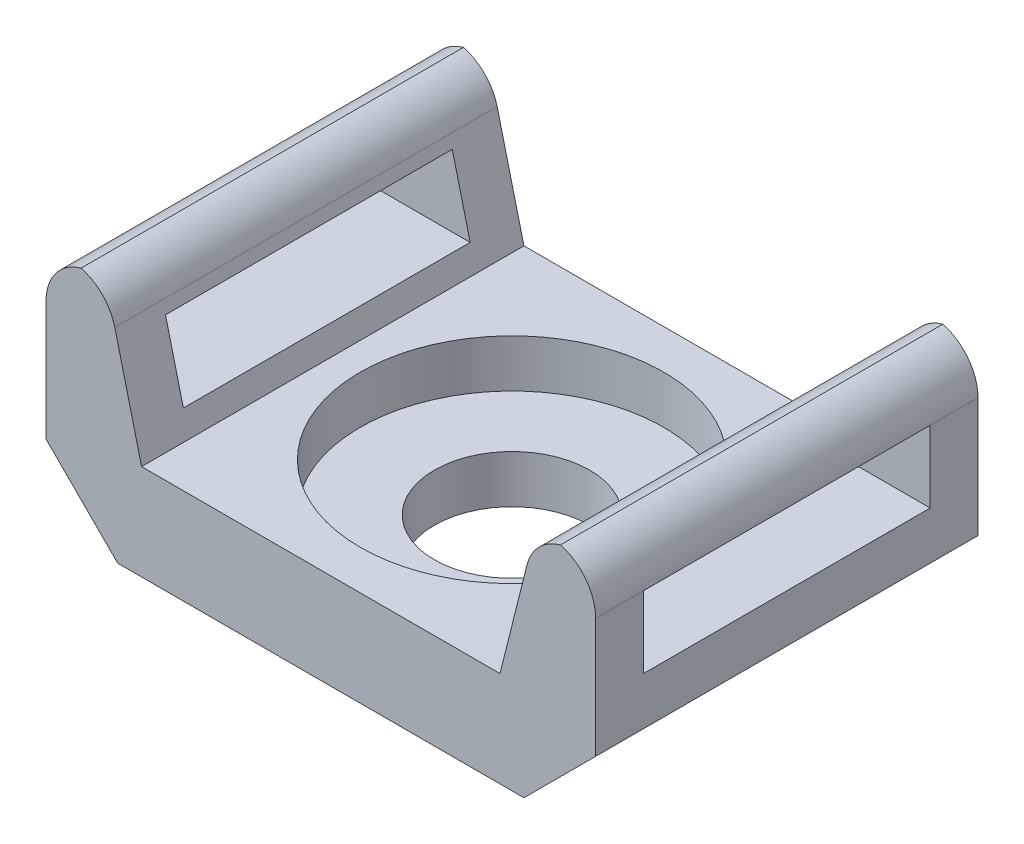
ISO-10303-21;
HEADER;
FILE_DESCRIPTION(('STEP AP214'),'2;1');
FILE_NAME('part.step','',(''),(''),'','','');
FILE_SCHEMA(('AUTOMOTIVE_DESIGN { 1 0 10303 214 1 1 1 1 }'));
ENDSEC;
DATA;
#1=APPLICATION_CONTEXT('core data for automotive mechanical design processes');
#2=APPLICATION_PROTOCOL_DEFINITION('international standard','automotive_design',2000,#1);
#3=PRODUCT_CONTEXT('',#1,'mechanical');
#4=PRODUCT('Part','Part','',(#3));
#5=PRODUCT_RELATED_PRODUCT_CATEGORY('part','',(#4));
#6=PRODUCT_DEFINITION_FORMATION('','',#4);
#7=PRODUCT_DEFINITION_CONTEXT('part definition',#1,'design');
#8=PRODUCT_DEFINITION('design','',#6,#7);
#9=PRODUCT_DEFINITION_SHAPE('','',#8);
#10=(LENGTH_UNIT() NAMED_UNIT(*) SI_UNIT(.MILLI.,.METRE.));
#11=(NAMED_UNIT(*) PLANE_ANGLE_UNIT() SI_UNIT($,.RADIAN.));
#12=(NAMED_UNIT(*) SI_UNIT($,.STERADIAN.) SOLID_ANGLE_UNIT());
#13=UNCERTAINTY_MEASURE_WITH_UNIT(LENGTH_MEASURE(1.E-05),#10,'distance_accuracy_value','');
#14=(GEOMETRIC_REPRESENTATION_CONTEXT(3) GLOBAL_UNCERTAINTY_ASSIGNED_CONTEXT((#13)) GLOBAL_UNIT_ASSIGNED_CONTEXT((#10,
#11,#12)) REPRESENTATION_CONTEXT('',''));
#15=CARTESIAN_POINT('',(0.,0.,0.));
#16=DIRECTION('',(0.,0.,1.));
#17=DIRECTION('',(1.,0.,0.));
#18=AXIS2_PLACEMENT_3D('',#15,#16,#17);
#19=CARTESIAN_POINT('',(0.,0.,0.));
#20=DIRECTION('',(0.,1.,0.));
#21=DIRECTION('',(0.,0.,1.));
#22=AXIS2_PLACEMENT_3D('',#19,#20,#21);
#23=CYLINDRICAL_SURFACE('',#22,3.25);
#24=CARTESIAN_POINT('',(0.,0.,0.));
#25=DIRECTION('',(0.,1.,0.));
#26=DIRECTION('',(0.,0.,1.));
#27=AXIS2_PLACEMENT_3D('',#24,#25,#26);
#28=CIRCLE('',#27,3.25);
#29=CARTESIAN_POINT('',(0.,0.,3.25));
#30=VERTEX_POINT('',#29);
#31=EDGE_CURVE('E291',#30,#30,#28,.T.);
#32=ORIENTED_EDGE('',*,*,#31,.F.);
#33=EDGE_LOOP('',(#32));
#34=FACE_BOUND('',#33,.T.);
#35=CARTESIAN_POINT('',(0.,2.,0.));
#36=DIRECTION('',(0.,1.,0.));
#37=DIRECTION('',(0.,0.,1.));
#38=AXIS2_PLACEMENT_3D('',#35,#36,#37);
#39=CIRCLE('',#38,3.25);
#40=CARTESIAN_POINT('',(0.,2.,3.25));
#41=VERTEX_POINT('',#40);
#42=EDGE_CURVE('E288',#41,#41,#39,.F.);
#43=ORIENTED_EDGE('',*,*,#42,.F.);
#44=EDGE_LOOP('',(#43));
#45=FACE_BOUND('',#44,.T.);
#46=ADVANCED_FACE('F35',(#34,#45),#23,.F.);
#47=CARTESIAN_POINT('',(11.5,10.,-8.));
#48=DIRECTION('',(-1.,0.,0.));
#49=DIRECTION('',(0.,0.,1.));
#50=AXIS2_PLACEMENT_3D('',#47,#48,#49);
#51=PLANE('',#50);
#52=DIRECTION('',(0.,-1.,0.));
#53=VECTOR('',#52,1.);
#54=CARTESIAN_POINT('',(11.5,10.,8.));
#55=LINE('',#54,#53);
#56=CARTESIAN_POINT('',(11.5,8.,8.));
#57=VERTEX_POINT('',#56);
#58=CARTESIAN_POINT('',(11.5,3.,8.));
#59=VERTEX_POINT('',#58);
#60=EDGE_CURVE('E277',#57,#59,#55,.T.);
#61=ORIENTED_EDGE('',*,*,#60,.T.);
#62=DIRECTION('',(0.,0.,-1.));
#63=VECTOR('',#62,1.);
#64=CARTESIAN_POINT('',(11.5,3.,-8.));
#65=LINE('',#64,#63);
#66=CARTESIAN_POINT('',(11.5,3.,-8.));
#67=VERTEX_POINT('',#66);
#68=EDGE_CURVE('E11',#59,#67,#65,.T.);
#69=ORIENTED_EDGE('',*,*,#68,.T.);
#70=DIRECTION('',(0.,-1.,0.));
#71=VECTOR('',#70,1.);
#72=CARTESIAN_POINT('',(11.5,10.,-8.));
#73=LINE('',#72,#71);
#74=CARTESIAN_POINT('',(11.5,8.,-8.));
#75=VERTEX_POINT('',#74);
#76=EDGE_CURVE('E267',#75,#67,#73,.T.);
#77=ORIENTED_EDGE('',*,*,#76,.F.);
#78=DIRECTION('',(0.,0.,-1.));
#79=VECTOR('',#78,1.);
#80=CARTESIAN_POINT('',(11.5,8.,8.));
#81=LINE('',#80,#79);
#82=CARTESIAN_POINT('',(11.5,8.,-6.));
#83=VERTEX_POINT('',#82);
#84=EDGE_CURVE('E212',#75,#83,#81,.F.);
#85=ORIENTED_EDGE('',*,*,#84,.T.);
#86=DIRECTION('',(0.,1.,0.));
#87=VECTOR('',#86,1.);
#88=CARTESIAN_POINT('',(11.5,8.,-6.));
#89=LINE('',#88,#87);
#90=CARTESIAN_POINT('',(11.5,5.,-6.));
#91=VERTEX_POINT('',#90);
#92=EDGE_CURVE('E197',#91,#83,#89,.T.);
#93=ORIENTED_EDGE('',*,*,#92,.F.);
#94=DIRECTION('',(0.,0.,-1.));
#95=VECTOR('',#94,1.);
#96=CARTESIAN_POINT('',(11.5,5.,6.));
#97=LINE('',#96,#95);
#98=CARTESIAN_POINT('',(11.5,5.,6.));
#99=VERTEX_POINT('',#98);
#100=EDGE_CURVE('E206',#99,#91,#97,.T.);
#101=ORIENTED_EDGE('',*,*,#100,.F.);
#102=DIRECTION('',(0.,-1.,0.));
#103=VECTOR('',#102,1.);
#104=CARTESIAN_POINT('',(11.5,8.,6.));
#105=LINE('',#104,#103);
#106=CARTESIAN_POINT('',(11.5,8.,6.));
#107=VERTEX_POINT('',#106);
#108=EDGE_CURVE('E179',#107,#99,#105,.T.);
#109=ORIENTED_EDGE('',*,*,#108,.F.);
#110=DIRECTION('',(0.,0.,-1.));
#111=VECTOR('',#110,1.);
#112=CARTESIAN_POINT('',(11.5,8.,8.));
#113=LINE('',#112,#111);
#114=EDGE_CURVE('E202',#107,#57,#113,.F.);
#115=ORIENTED_EDGE('',*,*,#114,.T.);
#116=EDGE_LOOP('',(#61,#69,#77,#85,#93,#101,#109,#115));
#117=FACE_BOUND('',#116,.T.);
#118=ADVANCED_FACE('F201',(#117),#51,.F.);
#119=CARTESIAN_POINT('',(-11.5,10.,-8.));
#120=DIRECTION('',(0.,0.,1.));
#121=DIRECTION('',(1.,0.,0.));
#122=AXIS2_PLACEMENT_3D('',#119,#120,#121);
#123=PLANE('',#122);
#124=DIRECTION('',(-1.,0.,0.));
#125=VECTOR('',#124,1.);
#126=CARTESIAN_POINT('',(-11.5,0.,-8.));
#127=LINE('',#126,#125);
#128=CARTESIAN_POINT('',(8.5,0.,-8.));
#129=VERTEX_POINT('',#128);
#130=CARTESIAN_POINT('',(-8.49999999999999,0.,-8.));
#131=VERTEX_POINT('',#130);
#132=EDGE_CURVE('E258',#129,#131,#127,.T.);
#133=ORIENTED_EDGE('',*,*,#132,.T.);
#134=DIRECTION('',(0.707106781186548,-0.707106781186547,0.));
#135=VECTOR('',#134,1.);
#136=CARTESIAN_POINT('',(-11.5,3.,-8.));
#137=LINE('',#136,#135);
#138=CARTESIAN_POINT('',(-11.5,3.,-8.));
#139=VERTEX_POINT('',#138);
#140=EDGE_CURVE('E43',#131,#139,#137,.F.);
#141=ORIENTED_EDGE('',*,*,#140,.T.);
#142=DIRECTION('',(0.,-1.,0.));
#143=VECTOR('',#142,1.);
#144=CARTESIAN_POINT('',(-11.5,10.,-8.));
#145=LINE('',#144,#143);
#146=CARTESIAN_POINT('',(-11.5,8.,-8.));
#147=VERTEX_POINT('',#146);
#148=EDGE_CURVE('E256',#147,#139,#145,.T.);
#149=ORIENTED_EDGE('',*,*,#148,.F.);
#150=CARTESIAN_POINT('',(-9.5,8.,-8.));
#151=DIRECTION('',(0.,0.,1.));
#152=DIRECTION('',(1.,0.,0.));
#153=AXIS2_PLACEMENT_3D('',#150,#151,#152);
#154=CIRCLE('',#153,2.);
#155=CARTESIAN_POINT('',(-10.0307764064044,9.92828327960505,-8.));
#156=VERTEX_POINT('',#155);
#157=EDGE_CURVE('E301',#147,#156,#154,.F.);
#158=ORIENTED_EDGE('',*,*,#157,.T.);
#159=CARTESIAN_POINT('',(-10.5615528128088,8.,-8.));
#160=DIRECTION('',(0.,0.,1.));
#161=DIRECTION('',(1.,0.,0.));
#162=AXIS2_PLACEMENT_3D('',#159,#160,#161);
#163=CIRCLE('',#162,2.);
#164=CARTESIAN_POINT('',(-8.62126781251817,8.48507125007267,-8.));
#165=VERTEX_POINT('',#164);
#166=EDGE_CURVE('E303',#156,#165,#163,.F.);
#167=ORIENTED_EDGE('',*,*,#166,.T.);
#168=DIRECTION('',(0.242535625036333,-0.970142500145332,0.));
#169=VECTOR('',#168,1.);
#170=CARTESIAN_POINT('',(-9.,10.,-8.));
#171=LINE('',#170,#169);
#172=CARTESIAN_POINT('',(-7.5,4.,-8.));
#173=VERTEX_POINT('',#172);
#174=EDGE_CURVE('E371',#165,#173,#171,.T.);
#175=ORIENTED_EDGE('',*,*,#174,.T.);
#176=DIRECTION('',(1.,0.,0.));
#177=VECTOR('',#176,1.);
#178=CARTESIAN_POINT('',(-7.5,4.,-8.));
#179=LINE('',#178,#177);
#180=CARTESIAN_POINT('',(7.5,4.,-8.));
#181=VERTEX_POINT('',#180);
#182=EDGE_CURVE('E373',#173,#181,#179,.T.);
#183=ORIENTED_EDGE('',*,*,#182,.T.);
#184=DIRECTION('',(0.242535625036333,0.970142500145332,0.));
#185=VECTOR('',#184,1.);
#186=CARTESIAN_POINT('',(7.5,4.,-8.));
#187=LINE('',#186,#185);
#188=CARTESIAN_POINT('',(8.62126781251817,8.48507125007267,-8.));
#189=VERTEX_POINT('',#188);
#190=EDGE_CURVE('E311',#181,#189,#187,.T.);
#191=ORIENTED_EDGE('',*,*,#190,.T.);
#192=CARTESIAN_POINT('',(10.5615528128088,8.,-8.));
#193=DIRECTION('',(0.,0.,1.));
#194=DIRECTION('',(1.,0.,0.));
#195=AXIS2_PLACEMENT_3D('',#192,#193,#194);
#196=CIRCLE('',#195,2.);
#197=CARTESIAN_POINT('',(10.0307764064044,9.92828327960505,-8.));
#198=VERTEX_POINT('',#197);
#199=EDGE_CURVE('E217',#189,#198,#196,.F.);
#200=ORIENTED_EDGE('',*,*,#199,.T.);
#201=CARTESIAN_POINT('',(9.5,8.,-8.));
#202=DIRECTION('',(0.,0.,1.));
#203=DIRECTION('',(1.,0.,0.));
#204=AXIS2_PLACEMENT_3D('',#201,#202,#203);
#205=CIRCLE('',#204,2.);
#206=EDGE_CURVE('E213',#198,#75,#205,.F.);
#207=ORIENTED_EDGE('',*,*,#206,.T.);
#208=ORIENTED_EDGE('',*,*,#76,.T.);
#209=DIRECTION('',(0.707106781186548,0.707106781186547,0.));
#210=VECTOR('',#209,1.);
#211=CARTESIAN_POINT('',(11.5,3.,-8.));
#212=LINE('',#211,#210);
#213=EDGE_CURVE('E50',#67,#129,#212,.F.);
#214=ORIENTED_EDGE('',*,*,#213,.T.);
#215=EDGE_LOOP('',(#133,#141,#149,#158,#167,#175,#183,#191,#200,#207,#208,#214));
#216=FACE_BOUND('',#215,.T.);
#217=ADVANCED_FACE('F255',(#216),#123,.F.);
#218=CARTESIAN_POINT('',(-11.5,10.,-8.));
#219=DIRECTION('',(1.,0.,0.));
#220=DIRECTION('',(0.,0.,-1.));
#221=AXIS2_PLACEMENT_3D('',#218,#219,#220);
#222=PLANE('',#221);
#223=ORIENTED_EDGE('',*,*,#148,.T.);
#224=DIRECTION('',(0.,0.,1.));
#225=VECTOR('',#224,1.);
#226=CARTESIAN_POINT('',(-11.5,3.,-8.));
#227=LINE('',#226,#225);
#228=CARTESIAN_POINT('',(-11.5,3.,8.));
#229=VERTEX_POINT('',#228);
#230=EDGE_CURVE('E236',#139,#229,#227,.T.);
#231=ORIENTED_EDGE('',*,*,#230,.T.);
#232=DIRECTION('',(0.,-1.,0.));
#233=VECTOR('',#232,1.);
#234=CARTESIAN_POINT('',(-11.5,10.,8.));
#235=LINE('',#234,#233);
#236=CARTESIAN_POINT('',(-11.5,8.,8.));
#237=VERTEX_POINT('',#236);
#238=EDGE_CURVE('E268',#237,#229,#235,.T.);
#239=ORIENTED_EDGE('',*,*,#238,.F.);
#240=DIRECTION('',(0.,0.,1.));
#241=VECTOR('',#240,1.);
#242=CARTESIAN_POINT('',(-11.5,8.,-8.));
#243=LINE('',#242,#241);
#244=CARTESIAN_POINT('',(-11.5,8.,6.));
#245=VERTEX_POINT('',#244);
#246=EDGE_CURVE('E234',#237,#245,#243,.F.);
#247=ORIENTED_EDGE('',*,*,#246,.T.);
#248=DIRECTION('',(0.,-1.,0.));
#249=VECTOR('',#248,1.);
#250=CARTESIAN_POINT('',(-11.5,8.,6.));
#251=LINE('',#250,#249);
#252=CARTESIAN_POINT('',(-11.5,5.,6.));
#253=VERTEX_POINT('',#252);
#254=EDGE_CURVE('E329',#245,#253,#251,.T.);
#255=ORIENTED_EDGE('',*,*,#254,.T.);
#256=DIRECTION('',(0.,0.,-1.));
#257=VECTOR('',#256,1.);
#258=CARTESIAN_POINT('',(-11.5,5.,6.));
#259=LINE('',#258,#257);
#260=CARTESIAN_POINT('',(-11.5,5.,-6.));
#261=VERTEX_POINT('',#260);
#262=EDGE_CURVE('E332',#253,#261,#259,.T.);
#263=ORIENTED_EDGE('',*,*,#262,.T.);
#264=DIRECTION('',(0.,1.,0.));
#265=VECTOR('',#264,1.);
#266=CARTESIAN_POINT('',(-11.5,8.,-6.));
#267=LINE('',#266,#265);
#268=CARTESIAN_POINT('',(-11.5,8.,-6.));
#269=VERTEX_POINT('',#268);
#270=EDGE_CURVE('E324',#261,#269,#267,.T.);
#271=ORIENTED_EDGE('',*,*,#270,.T.);
#272=DIRECTION('',(0.,0.,1.));
#273=VECTOR('',#272,1.);
#274=CARTESIAN_POINT('',(-11.5,8.,-8.));
#275=LINE('',#274,#273);
#276=EDGE_CURVE('E232',#269,#147,#275,.F.);
#277=ORIENTED_EDGE('',*,*,#276,.T.);
#278=EDGE_LOOP('',(#223,#231,#239,#247,#255,#263,#271,#277));
#279=FACE_BOUND('',#278,.T.);
#280=ADVANCED_FACE('F262',(#279),#222,.F.);
#281=CARTESIAN_POINT('',(-11.5,10.,8.));
#282=DIRECTION('',(0.,0.,-1.));
#283=DIRECTION('',(-1.,0.,0.));
#284=AXIS2_PLACEMENT_3D('',#281,#282,#283);
#285=PLANE('',#284);
#286=ORIENTED_EDGE('',*,*,#238,.T.);
#287=DIRECTION('',(-0.707106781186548,0.707106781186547,0.));
#288=VECTOR('',#287,1.);
#289=CARTESIAN_POINT('',(-11.5,3.,8.));
#290=LINE('',#289,#288);
#291=CARTESIAN_POINT('',(-8.49999999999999,0.,8.));
#292=VERTEX_POINT('',#291);
#293=EDGE_CURVE('E246',#229,#292,#290,.F.);
#294=ORIENTED_EDGE('',*,*,#293,.T.);
#295=DIRECTION('',(1.,0.,0.));
#296=VECTOR('',#295,1.);
#297=CARTESIAN_POINT('',(-11.5,0.,8.));
#298=LINE('',#297,#296);
#299=CARTESIAN_POINT('',(8.5,0.,8.));
#300=VERTEX_POINT('',#299);
#301=EDGE_CURVE('E274',#292,#300,#298,.T.);
#302=ORIENTED_EDGE('',*,*,#301,.T.);
#303=DIRECTION('',(-0.707106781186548,-0.707106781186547,0.));
#304=VECTOR('',#303,1.);
#305=CARTESIAN_POINT('',(11.5,3.,8.));
#306=LINE('',#305,#304);
#307=EDGE_CURVE('E244',#300,#59,#306,.F.);
#308=ORIENTED_EDGE('',*,*,#307,.T.);
#309=ORIENTED_EDGE('',*,*,#60,.F.);
#310=CARTESIAN_POINT('',(9.5,8.,8.));
#311=DIRECTION('',(0.,0.,-1.));
#312=DIRECTION('',(-1.,0.,0.));
#313=AXIS2_PLACEMENT_3D('',#310,#311,#312);
#314=CIRCLE('',#313,2.);
#315=CARTESIAN_POINT('',(10.0307764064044,9.92828327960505,8.));
#316=VERTEX_POINT('',#315);
#317=EDGE_CURVE('E211',#57,#316,#314,.F.);
#318=ORIENTED_EDGE('',*,*,#317,.T.);
#319=CARTESIAN_POINT('',(10.5615528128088,8.,8.));
#320=DIRECTION('',(0.,0.,-1.));
#321=DIRECTION('',(-1.,0.,0.));
#322=AXIS2_PLACEMENT_3D('',#319,#320,#321);
#323=CIRCLE('',#322,2.);
#324=CARTESIAN_POINT('',(8.62126781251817,8.48507125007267,8.));
#325=VERTEX_POINT('',#324);
#326=EDGE_CURVE('E224',#316,#325,#323,.F.);
#327=ORIENTED_EDGE('',*,*,#326,.T.);
#328=DIRECTION('',(0.242535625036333,0.970142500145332,0.));
#329=VECTOR('',#328,1.);
#330=CARTESIAN_POINT('',(7.5,4.,8.));
#331=LINE('',#330,#329);
#332=CARTESIAN_POINT('',(7.5,4.,8.));
#333=VERTEX_POINT('',#332);
#334=EDGE_CURVE('E368',#333,#325,#331,.T.);
#335=ORIENTED_EDGE('',*,*,#334,.F.);
#336=DIRECTION('',(1.,0.,0.));
#337=VECTOR('',#336,1.);
#338=CARTESIAN_POINT('',(-7.5,4.,8.));
#339=LINE('',#338,#337);
#340=CARTESIAN_POINT('',(-7.5,4.,8.));
#341=VERTEX_POINT('',#340);
#342=EDGE_CURVE('E365',#341,#333,#339,.T.);
#343=ORIENTED_EDGE('',*,*,#342,.F.);
#344=DIRECTION('',(0.242535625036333,-0.970142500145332,0.));
#345=VECTOR('',#344,1.);
#346=CARTESIAN_POINT('',(-9.,10.,8.));
#347=LINE('',#346,#345);
#348=CARTESIAN_POINT('',(-8.62126781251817,8.48507125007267,8.));
#349=VERTEX_POINT('',#348);
#350=EDGE_CURVE('E363',#349,#341,#347,.T.);
#351=ORIENTED_EDGE('',*,*,#350,.F.);
#352=CARTESIAN_POINT('',(-10.5615528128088,8.,8.));
#353=DIRECTION('',(0.,0.,-1.));
#354=DIRECTION('',(-1.,0.,0.));
#355=AXIS2_PLACEMENT_3D('',#352,#353,#354);
#356=CIRCLE('',#355,2.);
#357=CARTESIAN_POINT('',(-10.0307764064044,9.92828327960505,8.));
#358=VERTEX_POINT('',#357);
#359=EDGE_CURVE('E222',#349,#358,#356,.F.);
#360=ORIENTED_EDGE('',*,*,#359,.T.);
#361=CARTESIAN_POINT('',(-9.5,8.,8.));
#362=DIRECTION('',(0.,0.,-1.));
#363=DIRECTION('',(-1.,0.,0.));
#364=AXIS2_PLACEMENT_3D('',#361,#362,#363);
#365=CIRCLE('',#364,2.);
#366=EDGE_CURVE('E215',#358,#237,#365,.F.);
#367=ORIENTED_EDGE('',*,*,#366,.T.);
#368=EDGE_LOOP('',(#286,#294,#302,#308,#309,#318,#327,#335,#343,#351,#360,#367));
#369=FACE_BOUND('',#368,.T.);
#370=ADVANCED_FACE('F273',(#369),#285,.F.);
#371=CARTESIAN_POINT('',(0.,0.,0.));
#372=DIRECTION('',(0.,1.,0.));
#373=DIRECTION('',(0.,0.,1.));
#374=AXIS2_PLACEMENT_3D('',#371,#372,#373);
#375=PLANE('',#374);
#376=ORIENTED_EDGE('',*,*,#31,.T.);
#377=EDGE_LOOP('',(#376));
#378=FACE_BOUND('',#377,.T.);
#379=ORIENTED_EDGE('',*,*,#301,.F.);
#380=DIRECTION('',(0.,0.,-1.));
#381=VECTOR('',#380,1.);
#382=CARTESIAN_POINT('',(-8.49999999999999,0.,0.));
#383=LINE('',#382,#381);
#384=EDGE_CURVE('E57',#292,#131,#383,.T.);
#385=ORIENTED_EDGE('',*,*,#384,.T.);
#386=ORIENTED_EDGE('',*,*,#132,.F.);
#387=DIRECTION('',(0.,0.,1.));
#388=VECTOR('',#387,1.);
#389=CARTESIAN_POINT('',(8.5,0.,0.));
#390=LINE('',#389,#388);
#391=EDGE_CURVE('E248',#129,#300,#390,.T.);
#392=ORIENTED_EDGE('',*,*,#391,.T.);
#393=EDGE_LOOP('',(#379,#385,#386,#392));
#394=FACE_BOUND('',#393,.T.);
#395=ADVANCED_FACE('F276',(#378,#394),#375,.F.);
#396=CARTESIAN_POINT('',(-9.,10.,-8.));
#397=DIRECTION('',(-0.970142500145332,-0.242535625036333,0.));
#398=DIRECTION('',(0.242535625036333,-0.970142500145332,0.));
#399=AXIS2_PLACEMENT_3D('',#396,#397,#398);
#400=PLANE('',#399);
#401=DIRECTION('',(0.,0.,-1.));
#402=VECTOR('',#401,1.);
#403=CARTESIAN_POINT('',(-8.5,8.,-8.));
#404=LINE('',#403,#402);
#405=CARTESIAN_POINT('',(-8.5,8.,6.));
#406=VERTEX_POINT('',#405);
#407=CARTESIAN_POINT('',(-8.5,8.,-6.));
#408=VERTEX_POINT('',#407);
#409=EDGE_CURVE('E338',#406,#408,#404,.T.);
#410=ORIENTED_EDGE('',*,*,#409,.T.);
#411=DIRECTION('',(0.242535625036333,-0.970142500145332,0.));
#412=VECTOR('',#411,1.);
#413=CARTESIAN_POINT('',(-9.,10.,-6.));
#414=LINE('',#413,#412);
#415=CARTESIAN_POINT('',(-7.75,5.,-6.));
#416=VERTEX_POINT('',#415);
#417=EDGE_CURVE('E353',#408,#416,#414,.T.);
#418=ORIENTED_EDGE('',*,*,#417,.T.);
#419=DIRECTION('',(0.,0.,1.));
#420=VECTOR('',#419,1.);
#421=CARTESIAN_POINT('',(-7.75,5.,-8.));
#422=LINE('',#421,#420);
#423=CARTESIAN_POINT('',(-7.75,5.,6.));
#424=VERTEX_POINT('',#423);
#425=EDGE_CURVE('E350',#416,#424,#422,.T.);
#426=ORIENTED_EDGE('',*,*,#425,.T.);
#427=DIRECTION('',(-0.242535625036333,0.970142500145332,0.));
#428=VECTOR('',#427,1.);
#429=CARTESIAN_POINT('',(-9.,10.,6.));
#430=LINE('',#429,#428);
#431=EDGE_CURVE('E347',#424,#406,#430,.T.);
#432=ORIENTED_EDGE('',*,*,#431,.T.);
#433=EDGE_LOOP('',(#410,#418,#426,#432));
#434=FACE_BOUND('',#433,.T.);
#435=ORIENTED_EDGE('',*,*,#174,.F.);
#436=DIRECTION('',(0.,0.,1.));
#437=VECTOR('',#436,1.);
#438=CARTESIAN_POINT('',(-8.62126781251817,8.48507125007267,8.));
#439=LINE('',#438,#437);
#440=EDGE_CURVE('E229',#165,#349,#439,.T.);
#441=ORIENTED_EDGE('',*,*,#440,.T.);
#442=ORIENTED_EDGE('',*,*,#350,.T.);
#443=DIRECTION('',(0.,0.,1.));
#444=VECTOR('',#443,1.);
#445=CARTESIAN_POINT('',(-7.5,4.,-8.));
#446=LINE('',#445,#444);
#447=EDGE_CURVE('E376',#173,#341,#446,.T.);
#448=ORIENTED_EDGE('',*,*,#447,.F.);
#449=EDGE_LOOP('',(#435,#441,#442,#448));
#450=FACE_BOUND('',#449,.T.);
#451=ADVANCED_FACE('F391',(#434,#450),#400,.F.);
#452=CARTESIAN_POINT('',(7.5,4.,-8.));
#453=DIRECTION('',(0.970142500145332,-0.242535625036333,0.));
#454=DIRECTION('',(0.242535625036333,0.970142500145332,0.));
#455=AXIS2_PLACEMENT_3D('',#452,#453,#454);
#456=PLANE('',#455);
#457=DIRECTION('',(0.,0.,-1.));
#458=VECTOR('',#457,1.);
#459=CARTESIAN_POINT('',(7.75,5.,-8.));
#460=LINE('',#459,#458);
#461=CARTESIAN_POINT('',(7.75,5.,6.));
#462=VERTEX_POINT('',#461);
#463=CARTESIAN_POINT('',(7.75,5.,-6.));
#464=VERTEX_POINT('',#463);
#465=EDGE_CURVE('E295',#462,#464,#460,.T.);
#466=ORIENTED_EDGE('',*,*,#465,.T.);
#467=DIRECTION('',(0.242535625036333,0.970142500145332,0.));
#468=VECTOR('',#467,1.);
#469=CARTESIAN_POINT('',(7.5,4.,-6.));
#470=LINE('',#469,#468);
#471=CARTESIAN_POINT('',(8.5,8.,-6.));
#472=VERTEX_POINT('',#471);
#473=EDGE_CURVE('E298',#464,#472,#470,.T.);
#474=ORIENTED_EDGE('',*,*,#473,.T.);
#475=DIRECTION('',(0.,0.,1.));
#476=VECTOR('',#475,1.);
#477=CARTESIAN_POINT('',(8.5,8.,-8.));
#478=LINE('',#477,#476);
#479=CARTESIAN_POINT('',(8.5,8.,6.));
#480=VERTEX_POINT('',#479);
#481=EDGE_CURVE('E287',#472,#480,#478,.T.);
#482=ORIENTED_EDGE('',*,*,#481,.T.);
#483=DIRECTION('',(-0.242535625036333,-0.970142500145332,0.));
#484=VECTOR('',#483,1.);
#485=CARTESIAN_POINT('',(7.5,4.,6.));
#486=LINE('',#485,#484);
#487=EDGE_CURVE('E182',#480,#462,#486,.T.);
#488=ORIENTED_EDGE('',*,*,#487,.T.);
#489=EDGE_LOOP('',(#466,#474,#482,#488));
#490=FACE_BOUND('',#489,.T.);
#491=ORIENTED_EDGE('',*,*,#334,.T.);
#492=DIRECTION('',(0.,0.,1.));
#493=VECTOR('',#492,1.);
#494=CARTESIAN_POINT('',(8.62126781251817,8.48507125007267,-8.));
#495=LINE('',#494,#493);
#496=EDGE_CURVE('E227',#325,#189,#495,.F.);
#497=ORIENTED_EDGE('',*,*,#496,.T.);
#498=ORIENTED_EDGE('',*,*,#190,.F.);
#499=DIRECTION('',(0.,0.,1.));
#500=VECTOR('',#499,1.);
#501=CARTESIAN_POINT('',(7.5,4.,-8.));
#502=LINE('',#501,#500);
#503=EDGE_CURVE('E280',#181,#333,#502,.T.);
#504=ORIENTED_EDGE('',*,*,#503,.T.);
#505=EDGE_LOOP('',(#491,#497,#498,#504));
#506=FACE_BOUND('',#505,.T.);
#507=ADVANCED_FACE('F388',(#490,#506),#456,.F.);
#508=CARTESIAN_POINT('',(-7.5,4.,-8.));
#509=DIRECTION('',(0.,-1.,0.));
#510=DIRECTION('',(0.,0.,-1.));
#511=AXIS2_PLACEMENT_3D('',#508,#509,#510);
#512=PLANE('',#511);
#513=CARTESIAN_POINT('',(0.,4.,0.));
#514=DIRECTION('',(0.,1.,0.));
#515=DIRECTION('',(0.,0.,1.));
#516=AXIS2_PLACEMENT_3D('',#513,#514,#515);
#517=CIRCLE('',#516,6.35);
#518=CARTESIAN_POINT('',(0.,4.,6.35));
#519=VERTEX_POINT('',#518);
#520=EDGE_CURVE('E356',#519,#519,#517,.T.);
#521=ORIENTED_EDGE('',*,*,#520,.F.);
#522=EDGE_LOOP('',(#521));
#523=FACE_BOUND('',#522,.T.);
#524=ORIENTED_EDGE('',*,*,#503,.F.);
#525=ORIENTED_EDGE('',*,*,#182,.F.);
#526=ORIENTED_EDGE('',*,*,#447,.T.);
#527=ORIENTED_EDGE('',*,*,#342,.T.);
#528=EDGE_LOOP('',(#524,#525,#526,#527));
#529=FACE_BOUND('',#528,.T.);
#530=ADVANCED_FACE('F382',(#523,#529),#512,.F.);
#531=CARTESIAN_POINT('',(0.,2.,0.));
#532=DIRECTION('',(0.,1.,0.));
#533=DIRECTION('',(0.,0.,1.));
#534=AXIS2_PLACEMENT_3D('',#531,#532,#533);
#535=PLANE('',#534);
#536=CARTESIAN_POINT('',(0.,2.,0.));
#537=DIRECTION('',(0.,1.,0.));
#538=DIRECTION('',(0.,0.,1.));
#539=AXIS2_PLACEMENT_3D('',#536,#537,#538);
#540=CIRCLE('',#539,6.35);
#541=CARTESIAN_POINT('',(0.,2.,6.35));
#542=VERTEX_POINT('',#541);
#543=EDGE_CURVE('E292',#542,#542,#540,.T.);
#544=ORIENTED_EDGE('',*,*,#543,.T.);
#545=EDGE_LOOP('',(#544));
#546=FACE_BOUND('',#545,.T.);
#547=ORIENTED_EDGE('',*,*,#42,.T.);
#548=EDGE_LOOP('',(#547));
#549=FACE_BOUND('',#548,.T.);
#550=ADVANCED_FACE('F441',(#546,#549),#535,.T.);
#551=CARTESIAN_POINT('',(0.,2.,0.));
#552=DIRECTION('',(0.,1.,0.));
#553=DIRECTION('',(0.,0.,1.));
#554=AXIS2_PLACEMENT_3D('',#551,#552,#553);
#555=CYLINDRICAL_SURFACE('',#554,6.35);
#556=ORIENTED_EDGE('',*,*,#543,.F.);
#557=EDGE_LOOP('',(#556));
#558=FACE_BOUND('',#557,.T.);
#559=ORIENTED_EDGE('',*,*,#520,.T.);
#560=EDGE_LOOP('',(#559));
#561=FACE_BOUND('',#560,.T.);
#562=ADVANCED_FACE('F435',(#558,#561),#555,.F.);
#563=CARTESIAN_POINT('',(-11.5,8.,6.));
#564=DIRECTION('',(0.,1.,0.));
#565=DIRECTION('',(0.,0.,1.));
#566=AXIS2_PLACEMENT_3D('',#563,#564,#565);
#567=PLANE('',#566);
#568=DIRECTION('',(1.,0.,0.));
#569=VECTOR('',#568,1.);
#570=CARTESIAN_POINT('',(-11.5,8.,-6.));
#571=LINE('',#570,#569);
#572=EDGE_CURVE('E192',#472,#83,#571,.T.);
#573=ORIENTED_EDGE('',*,*,#572,.T.);
#574=DIRECTION('',(0.,0.,1.));
#575=VECTOR('',#574,1.);
#576=CARTESIAN_POINT('',(11.5,8.,6.));
#577=LINE('',#576,#575);
#578=EDGE_CURVE('E189',#83,#107,#577,.T.);
#579=ORIENTED_EDGE('',*,*,#578,.T.);
#580=DIRECTION('',(1.,0.,0.));
#581=VECTOR('',#580,1.);
#582=CARTESIAN_POINT('',(-11.5,8.,6.));
#583=LINE('',#582,#581);
#584=EDGE_CURVE('E174',#480,#107,#583,.T.);
#585=ORIENTED_EDGE('',*,*,#584,.F.);
#586=ORIENTED_EDGE('',*,*,#481,.F.);
#587=EDGE_LOOP('',(#573,#579,#585,#586));
#588=FACE_BOUND('',#587,.T.);
#589=ADVANCED_FACE('F190',(#588),#567,.F.);
#590=CARTESIAN_POINT('',(-11.5,8.,6.));
#591=DIRECTION('',(0.,0.,1.));
#592=DIRECTION('',(1.,0.,0.));
#593=AXIS2_PLACEMENT_3D('',#590,#591,#592);
#594=PLANE('',#593);
#595=ORIENTED_EDGE('',*,*,#584,.T.);
#596=ORIENTED_EDGE('',*,*,#108,.T.);
#597=DIRECTION('',(1.,0.,0.));
#598=VECTOR('',#597,1.);
#599=CARTESIAN_POINT('',(-11.5,5.,6.));
#600=LINE('',#599,#598);
#601=EDGE_CURVE('E341',#462,#99,#600,.T.);
#602=ORIENTED_EDGE('',*,*,#601,.F.);
#603=ORIENTED_EDGE('',*,*,#487,.F.);
#604=EDGE_LOOP('',(#595,#596,#602,#603));
#605=FACE_BOUND('',#604,.T.);
#606=ADVANCED_FACE('F176',(#605),#594,.F.);
#607=CARTESIAN_POINT('',(-11.5,5.,6.));
#608=DIRECTION('',(0.,-1.,0.));
#609=DIRECTION('',(0.,0.,-1.));
#610=AXIS2_PLACEMENT_3D('',#607,#608,#609);
#611=PLANE('',#610);
#612=ORIENTED_EDGE('',*,*,#601,.T.);
#613=ORIENTED_EDGE('',*,*,#100,.T.);
#614=DIRECTION('',(1.,0.,0.));
#615=VECTOR('',#614,1.);
#616=CARTESIAN_POINT('',(-11.5,5.,-6.));
#617=LINE('',#616,#615);
#618=EDGE_CURVE('E320',#464,#91,#617,.T.);
#619=ORIENTED_EDGE('',*,*,#618,.F.);
#620=ORIENTED_EDGE('',*,*,#465,.F.);
#621=EDGE_LOOP('',(#612,#613,#619,#620));
#622=FACE_BOUND('',#621,.T.);
#623=ADVANCED_FACE('F421',(#622),#611,.F.);
#624=CARTESIAN_POINT('',(-11.5,8.,-6.));
#625=DIRECTION('',(0.,0.,-1.));
#626=DIRECTION('',(-1.,0.,0.));
#627=AXIS2_PLACEMENT_3D('',#624,#625,#626);
#628=PLANE('',#627);
#629=ORIENTED_EDGE('',*,*,#618,.T.);
#630=ORIENTED_EDGE('',*,*,#92,.T.);
#631=ORIENTED_EDGE('',*,*,#572,.F.);
#632=ORIENTED_EDGE('',*,*,#473,.F.);
#633=EDGE_LOOP('',(#629,#630,#631,#632));
#634=FACE_BOUND('',#633,.T.);
#635=ADVANCED_FACE('F318',(#634),#628,.F.);
#636=EDGE_CURVE('E186',#269,#408,#571,.T.);
#637=ORIENTED_EDGE('',*,*,#636,.F.);
#638=ORIENTED_EDGE('',*,*,#270,.F.);
#639=EDGE_CURVE('E335',#261,#416,#617,.T.);
#640=ORIENTED_EDGE('',*,*,#639,.T.);
#641=ORIENTED_EDGE('',*,*,#417,.F.);
#642=EDGE_LOOP('',(#637,#638,#640,#641));
#643=FACE_BOUND('',#642,.T.);
#644=ADVANCED_FACE('F413',(#643),#628,.F.);
#645=ORIENTED_EDGE('',*,*,#639,.F.);
#646=ORIENTED_EDGE('',*,*,#262,.F.);
#647=EDGE_CURVE('E339',#253,#424,#600,.T.);
#648=ORIENTED_EDGE('',*,*,#647,.T.);
#649=ORIENTED_EDGE('',*,*,#425,.F.);
#650=EDGE_LOOP('',(#645,#646,#648,#649));
#651=FACE_BOUND('',#650,.T.);
#652=ADVANCED_FACE('F410',(#651),#611,.F.);
#653=ORIENTED_EDGE('',*,*,#647,.F.);
#654=ORIENTED_EDGE('',*,*,#254,.F.);
#655=EDGE_CURVE('E185',#245,#406,#583,.T.);
#656=ORIENTED_EDGE('',*,*,#655,.T.);
#657=ORIENTED_EDGE('',*,*,#431,.F.);
#658=EDGE_LOOP('',(#653,#654,#656,#657));
#659=FACE_BOUND('',#658,.T.);
#660=ADVANCED_FACE('F403',(#659),#594,.F.);
#661=ORIENTED_EDGE('',*,*,#655,.F.);
#662=DIRECTION('',(0.,0.,1.));
#663=VECTOR('',#662,1.);
#664=CARTESIAN_POINT('',(-11.5,8.,6.));
#665=LINE('',#664,#663);
#666=EDGE_CURVE('E326',#269,#245,#665,.T.);
#667=ORIENTED_EDGE('',*,*,#666,.F.);
#668=ORIENTED_EDGE('',*,*,#636,.T.);
#669=ORIENTED_EDGE('',*,*,#409,.F.);
#670=EDGE_LOOP('',(#661,#667,#668,#669));
#671=FACE_BOUND('',#670,.T.);
#672=ADVANCED_FACE('F406',(#671),#567,.F.);
#673=CARTESIAN_POINT('',(10.5615528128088,8.,0.));
#674=DIRECTION('',(0.,0.,-1.));
#675=DIRECTION('',(-1.,0.,0.));
#676=AXIS2_PLACEMENT_3D('',#673,#674,#675);
#677=CYLINDRICAL_SURFACE('',#676,2.);
#678=ORIENTED_EDGE('',*,*,#496,.F.);
#679=ORIENTED_EDGE('',*,*,#326,.F.);
#680=DIRECTION('',(0.,0.,-1.));
#681=VECTOR('',#680,1.);
#682=CARTESIAN_POINT('',(10.0307764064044,9.92828327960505,0.));
#683=LINE('',#682,#681);
#684=EDGE_CURVE('E237',#198,#316,#683,.F.);
#685=ORIENTED_EDGE('',*,*,#684,.F.);
#686=ORIENTED_EDGE('',*,*,#199,.F.);
#687=EDGE_LOOP('',(#678,#679,#685,#686));
#688=FACE_BOUND('',#687,.T.);
#689=ADVANCED_FACE('F315',(#688),#677,.T.);
#690=CARTESIAN_POINT('',(9.5,8.,0.));
#691=DIRECTION('',(0.,0.,1.));
#692=DIRECTION('',(1.,0.,0.));
#693=AXIS2_PLACEMENT_3D('',#690,#691,#692);
#694=CYLINDRICAL_SURFACE('',#693,2.);
#695=ORIENTED_EDGE('',*,*,#578,.F.);
#696=ORIENTED_EDGE('',*,*,#84,.F.);
#697=ORIENTED_EDGE('',*,*,#206,.F.);
#698=ORIENTED_EDGE('',*,*,#684,.T.);
#699=ORIENTED_EDGE('',*,*,#317,.F.);
#700=ORIENTED_EDGE('',*,*,#114,.F.);
#701=EDGE_LOOP('',(#695,#696,#697,#698,#699,#700));
#702=FACE_BOUND('',#701,.T.);
#703=ADVANCED_FACE('F209',(#702),#694,.T.);
#704=CARTESIAN_POINT('',(-9.5,8.,0.));
#705=DIRECTION('',(0.,0.,-1.));
#706=DIRECTION('',(-1.,0.,0.));
#707=AXIS2_PLACEMENT_3D('',#704,#705,#706);
#708=CYLINDRICAL_SURFACE('',#707,2.);
#709=DIRECTION('',(0.,0.,-1.));
#710=VECTOR('',#709,1.);
#711=CARTESIAN_POINT('',(-10.0307764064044,9.92828327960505,0.));
#712=LINE('',#711,#710);
#713=EDGE_CURVE('E239',#156,#358,#712,.F.);
#714=ORIENTED_EDGE('',*,*,#713,.F.);
#715=ORIENTED_EDGE('',*,*,#157,.F.);
#716=ORIENTED_EDGE('',*,*,#276,.F.);
#717=ORIENTED_EDGE('',*,*,#666,.T.);
#718=ORIENTED_EDGE('',*,*,#246,.F.);
#719=ORIENTED_EDGE('',*,*,#366,.F.);
#720=EDGE_LOOP('',(#714,#715,#716,#717,#718,#719));
#721=FACE_BOUND('',#720,.T.);
#722=ADVANCED_FACE('F398',(#721),#708,.T.);
#723=CARTESIAN_POINT('',(-10.5615528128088,8.,-8.));
#724=DIRECTION('',(0.,0.,-1.));
#725=DIRECTION('',(-1.,0.,0.));
#726=AXIS2_PLACEMENT_3D('',#723,#724,#725);
#727=CYLINDRICAL_SURFACE('',#726,2.);
#728=ORIENTED_EDGE('',*,*,#166,.F.);
#729=ORIENTED_EDGE('',*,*,#713,.T.);
#730=ORIENTED_EDGE('',*,*,#359,.F.);
#731=ORIENTED_EDGE('',*,*,#440,.F.);
#732=EDGE_LOOP('',(#728,#729,#730,#731));
#733=FACE_BOUND('',#732,.T.);
#734=ADVANCED_FACE('F393',(#733),#727,.T.);
#735=CARTESIAN_POINT('',(-11.5,3.,-8.));
#736=DIRECTION('',(0.707106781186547,0.707106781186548,0.));
#737=DIRECTION('',(0.,0.,1.));
#738=AXIS2_PLACEMENT_3D('',#735,#736,#737);
#739=PLANE('',#738);
#740=ORIENTED_EDGE('',*,*,#140,.F.);
#741=ORIENTED_EDGE('',*,*,#384,.F.);
#742=ORIENTED_EDGE('',*,*,#293,.F.);
#743=ORIENTED_EDGE('',*,*,#230,.F.);
#744=EDGE_LOOP('',(#740,#741,#742,#743));
#745=FACE_BOUND('',#744,.T.);
#746=ADVANCED_FACE('F270',(#745),#739,.F.);
#747=CARTESIAN_POINT('',(11.5,3.,-8.));
#748=DIRECTION('',(-0.707106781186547,0.707106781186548,0.));
#749=DIRECTION('',(0.,0.,-1.));
#750=AXIS2_PLACEMENT_3D('',#747,#748,#749);
#751=PLANE('',#750);
#752=ORIENTED_EDGE('',*,*,#307,.F.);
#753=ORIENTED_EDGE('',*,*,#391,.F.);
#754=ORIENTED_EDGE('',*,*,#213,.F.);
#755=ORIENTED_EDGE('',*,*,#68,.F.);
#756=EDGE_LOOP('',(#752,#753,#754,#755));
#757=FACE_BOUND('',#756,.T.);
#758=ADVANCED_FACE('F37',(#757),#751,.F.);
#759=CLOSED_SHELL('',(#46,#118,#217,#280,#370,#395,#451,#507,#530,#550,#562,#589,#606,#623,#635,
#644,#652,#660,#672,#689,#703,#722,#734,#746,#758));
#760=MANIFOLD_SOLID_BREP('B2',#759);
#761=ADVANCED_BREP_SHAPE_REPRESENTATION('',(#18,#760),#14);
#762=SHAPE_DEFINITION_REPRESENTATION(#9,#761);
ENDSEC;
END-ISO-10303-21;
